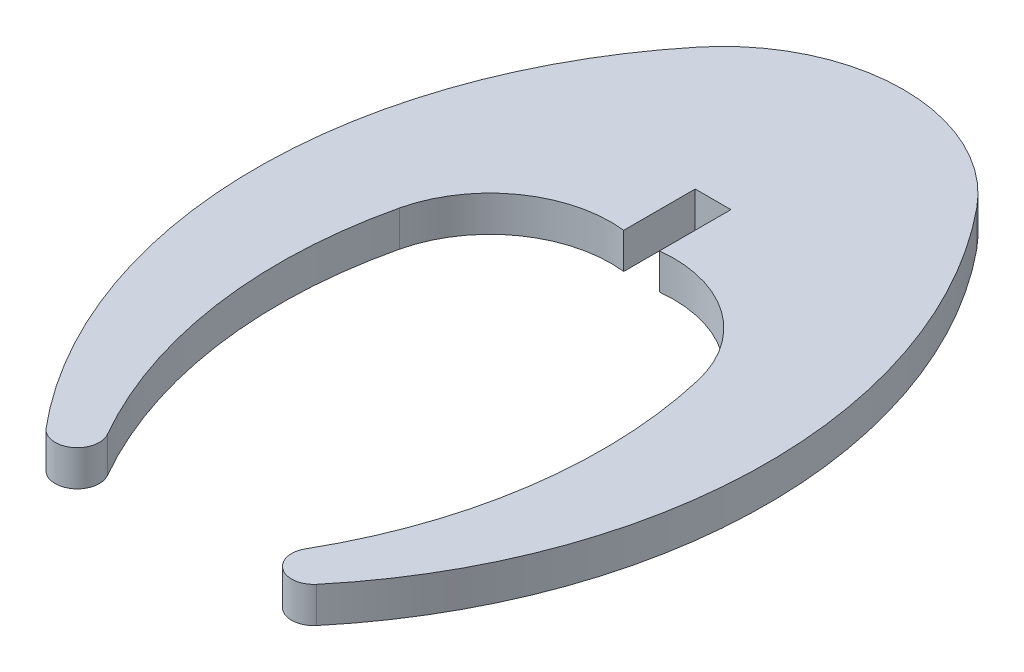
ISO-10303-21;
HEADER;
FILE_DESCRIPTION(('STEP AP214'),'2;1');
FILE_NAME('part.step','',(''),(''),'','','');
FILE_SCHEMA(('AUTOMOTIVE_DESIGN { 1 0 10303 214 1 1 1 1 }'));
ENDSEC;
DATA;
#1=APPLICATION_CONTEXT('core data for automotive mechanical design processes');
#2=APPLICATION_PROTOCOL_DEFINITION('international standard','automotive_design',2000,#1);
#3=PRODUCT_CONTEXT('',#1,'mechanical');
#4=PRODUCT('Part','Part','',(#3));
#5=PRODUCT_RELATED_PRODUCT_CATEGORY('part','',(#4));
#6=PRODUCT_DEFINITION_FORMATION('','',#4);
#7=PRODUCT_DEFINITION_CONTEXT('part definition',#1,'design');
#8=PRODUCT_DEFINITION('design','',#6,#7);
#9=PRODUCT_DEFINITION_SHAPE('','',#8);
#10=(LENGTH_UNIT() NAMED_UNIT(*) SI_UNIT(.MILLI.,.METRE.));
#11=(NAMED_UNIT(*) PLANE_ANGLE_UNIT() SI_UNIT($,.RADIAN.));
#12=(NAMED_UNIT(*) SI_UNIT($,.STERADIAN.) SOLID_ANGLE_UNIT());
#13=UNCERTAINTY_MEASURE_WITH_UNIT(LENGTH_MEASURE(1.E-05),#10,'distance_accuracy_value','');
#14=(GEOMETRIC_REPRESENTATION_CONTEXT(3) GLOBAL_UNCERTAINTY_ASSIGNED_CONTEXT((#13)) GLOBAL_UNIT_ASSIGNED_CONTEXT((#10,
#11,#12)) REPRESENTATION_CONTEXT('',''));
#15=CARTESIAN_POINT('',(0.,0.,0.));
#16=DIRECTION('',(0.,0.,1.));
#17=DIRECTION('',(1.,0.,0.));
#18=AXIS2_PLACEMENT_3D('',#15,#16,#17);
#19=CARTESIAN_POINT('',(-42090.820528,3.,-18279.410788));
#20=DIRECTION('',(-0.999999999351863,0.,-3.60037906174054E-05));
#21=DIRECTION('',(-3.60037906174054E-05,0.,0.999999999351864));
#22=AXIS2_PLACEMENT_3D('',#19,#20,#21);
#23=PLANE('',#22);
#24=DIRECTION('',(3.60037906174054E-05,0.,-0.999999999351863));
#25=VECTOR('',#24,1.);
#26=CARTESIAN_POINT('',(-42090.820528,0.,-18279.410788));
#27=LINE('',#26,#25);
#28=CARTESIAN_POINT('',(-42090.820528,0.,-18279.410788));
#29=VERTEX_POINT('',#28);
#30=CARTESIAN_POINT('',(-42090.820312,0.,-18285.410156));
#31=VERTEX_POINT('',#30);
#32=EDGE_CURVE('E156',#29,#31,#27,.T.);
#33=ORIENTED_EDGE('',*,*,#32,.T.);
#34=DIRECTION('',(0.,-1.,0.));
#35=VECTOR('',#34,1.);
#36=CARTESIAN_POINT('',(-42090.820312,3.,-18285.410156));
#37=LINE('',#36,#35);
#38=CARTESIAN_POINT('',(-42090.820312,3.,-18285.410156));
#39=VERTEX_POINT('',#38);
#40=EDGE_CURVE('E11',#39,#31,#37,.T.);
#41=ORIENTED_EDGE('',*,*,#40,.F.);
#42=DIRECTION('',(3.60037906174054E-05,0.,-0.999999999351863));
#43=VECTOR('',#42,1.);
#44=CARTESIAN_POINT('',(-42090.820528,3.,-18279.410788));
#45=LINE('',#44,#43);
#46=CARTESIAN_POINT('',(-42090.820528,3.,-18279.410788));
#47=VERTEX_POINT('',#46);
#48=EDGE_CURVE('E178',#47,#39,#45,.T.);
#49=ORIENTED_EDGE('',*,*,#48,.F.);
#50=DIRECTION('',(0.,-1.,0.));
#51=VECTOR('',#50,1.);
#52=CARTESIAN_POINT('',(-42090.820528,3.,-18279.410788));
#53=LINE('',#52,#51);
#54=EDGE_CURVE('E152',#47,#29,#53,.T.);
#55=ORIENTED_EDGE('',*,*,#54,.T.);
#56=EDGE_LOOP('',(#33,#41,#49,#55));
#57=FACE_BOUND('',#56,.T.);
#58=ADVANCED_FACE('F36',(#57),#23,.F.);
#59=CARTESIAN_POINT('',(-42090.820312,3.,-18285.410156));
#60=DIRECTION('',(-0.00065099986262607,0.,-0.999999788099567));
#61=DIRECTION('',(-0.999999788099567,0.,0.00065099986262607));
#62=AXIS2_PLACEMENT_3D('',#59,#60,#61);
#63=PLANE('',#62);
#64=DIRECTION('',(0.999999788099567,0.,-0.00065099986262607));
#65=VECTOR('',#64,1.);
#66=CARTESIAN_POINT('',(-42090.820312,0.,-18285.410156));
#67=LINE('',#66,#65);
#68=CARTESIAN_POINT('',(-42087.820312,0.,-18285.412109));
#69=VERTEX_POINT('',#68);
#70=EDGE_CURVE('E159',#31,#69,#67,.T.);
#71=ORIENTED_EDGE('',*,*,#70,.T.);
#72=DIRECTION('',(0.,-1.,0.));
#73=VECTOR('',#72,1.);
#74=CARTESIAN_POINT('',(-42087.820312,3.,-18285.412109));
#75=LINE('',#74,#73);
#76=CARTESIAN_POINT('',(-42087.820312,3.,-18285.412109));
#77=VERTEX_POINT('',#76);
#78=EDGE_CURVE('E44',#77,#69,#75,.T.);
#79=ORIENTED_EDGE('',*,*,#78,.F.);
#80=DIRECTION('',(0.999999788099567,0.,-0.00065099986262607));
#81=VECTOR('',#80,1.);
#82=CARTESIAN_POINT('',(-42090.820312,3.,-18285.410156));
#83=LINE('',#82,#81);
#84=EDGE_CURVE('E107',#39,#77,#83,.T.);
#85=ORIENTED_EDGE('',*,*,#84,.F.);
#86=ORIENTED_EDGE('',*,*,#40,.T.);
#87=EDGE_LOOP('',(#71,#79,#85,#86));
#88=FACE_BOUND('',#87,.T.);
#89=ADVANCED_FACE('F256',(#88),#63,.F.);
#90=CARTESIAN_POINT('',(-42087.820312,3.,-18285.412109));
#91=DIRECTION('',(1.,0.,3.55387046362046E-12));
#92=DIRECTION('',(3.55387046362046E-12,0.,-1.));
#93=AXIS2_PLACEMENT_3D('',#90,#91,#92);
#94=PLANE('',#93);
#95=DIRECTION('',(-3.55387046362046E-12,0.,1.));
#96=VECTOR('',#95,1.);
#97=CARTESIAN_POINT('',(-42087.820312,0.,-18285.412109));
#98=LINE('',#97,#96);
#99=CARTESIAN_POINT('',(-42087.820312,0.,-18279.414062));
#100=VERTEX_POINT('',#99);
#101=EDGE_CURVE('E161',#69,#100,#98,.T.);
#102=ORIENTED_EDGE('',*,*,#101,.T.);
#103=DIRECTION('',(0.,-1.,0.));
#104=VECTOR('',#103,1.);
#105=CARTESIAN_POINT('',(-42087.820312,3.,-18279.414062));
#106=LINE('',#105,#104);
#107=CARTESIAN_POINT('',(-42087.820312,3.,-18279.414062));
#108=VERTEX_POINT('',#107);
#109=EDGE_CURVE('E197',#108,#100,#106,.T.);
#110=ORIENTED_EDGE('',*,*,#109,.F.);
#111=DIRECTION('',(-3.55387046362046E-12,0.,1.));
#112=VECTOR('',#111,1.);
#113=CARTESIAN_POINT('',(-42087.820312,3.,-18285.412109));
#114=LINE('',#113,#112);
#115=EDGE_CURVE('E205',#77,#108,#114,.T.);
#116=ORIENTED_EDGE('',*,*,#115,.F.);
#117=ORIENTED_EDGE('',*,*,#78,.T.);
#118=EDGE_LOOP('',(#102,#110,#116,#117));
#119=FACE_BOUND('',#118,.T.);
#120=ADVANCED_FACE('F203',(#119),#94,.F.);
#121=CARTESIAN_POINT('',(-42086.6928866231,3.,-18269.3115927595));
#122=DIRECTION('',(0.,-1.,0.));
#123=DIRECTION('',(0.,0.,-1.));
#124=AXIS2_PLACEMENT_3D('',#121,#122,#123);
#125=CYLINDRICAL_SURFACE('',#124,10.1651843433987);
#126=CARTESIAN_POINT('',(-42086.6928866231,0.,-18269.3115927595));
#127=DIRECTION('',(0.,-1.,0.));
#128=DIRECTION('',(0.,0.,1.));
#129=AXIS2_PLACEMENT_3D('',#126,#127,#128);
#130=CIRCLE('',#129,10.1651843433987);
#131=CARTESIAN_POINT('',(-42076.7948740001,0.,-18271.626829));
#132=VERTEX_POINT('',#131);
#133=EDGE_CURVE('E163',#100,#132,#130,.T.);
#134=ORIENTED_EDGE('',*,*,#133,.T.);
#135=DIRECTION('',(0.,-1.,0.));
#136=VECTOR('',#135,1.);
#137=CARTESIAN_POINT('',(-42076.7948740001,3.,-18271.626829));
#138=LINE('',#137,#136);
#139=CARTESIAN_POINT('',(-42076.7948740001,3.,-18271.626829));
#140=VERTEX_POINT('',#139);
#141=EDGE_CURVE('E194',#140,#132,#138,.T.);
#142=ORIENTED_EDGE('',*,*,#141,.F.);
#143=CARTESIAN_POINT('',(-42086.6928866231,3.,-18269.3115927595));
#144=DIRECTION('',(0.,-1.,0.));
#145=DIRECTION('',(0.,0.,1.));
#146=AXIS2_PLACEMENT_3D('',#143,#144,#145);
#147=CIRCLE('',#146,10.1651843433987);
#148=EDGE_CURVE('E223',#108,#140,#147,.T.);
#149=ORIENTED_EDGE('',*,*,#148,.F.);
#150=ORIENTED_EDGE('',*,*,#109,.T.);
#151=EDGE_LOOP('',(#134,#142,#149,#150));
#152=FACE_BOUND('',#151,.T.);
#153=ADVANCED_FACE('F214',(#152),#125,.F.);
#154=CARTESIAN_POINT('',(-42115.347379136,3.,-18262.6034486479));
#155=DIRECTION('',(0.,-1.,0.));
#156=DIRECTION('',(0.,0.,-1.));
#157=AXIS2_PLACEMENT_3D('',#154,#155,#156);
#158=CYLINDRICAL_SURFACE('',#157,39.5944067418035);
#159=CARTESIAN_POINT('',(-42115.347379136,0.,-18262.6034486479));
#160=DIRECTION('',(0.,-1.,0.));
#161=DIRECTION('',(0.,0.,1.));
#162=AXIS2_PLACEMENT_3D('',#159,#160,#161);
#163=CIRCLE('',#162,39.5944067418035);
#164=CARTESIAN_POINT('',(-42081.0128680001,0.,-18242.883956));
#165=VERTEX_POINT('',#164);
#166=EDGE_CURVE('E165',#132,#165,#163,.T.);
#167=ORIENTED_EDGE('',*,*,#166,.T.);
#168=DIRECTION('',(0.,-1.,0.));
#169=VECTOR('',#168,1.);
#170=CARTESIAN_POINT('',(-42081.0128680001,3.,-18242.883956));
#171=LINE('',#170,#169);
#172=CARTESIAN_POINT('',(-42081.0128680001,3.,-18242.883956));
#173=VERTEX_POINT('',#172);
#174=EDGE_CURVE('E191',#173,#165,#171,.T.);
#175=ORIENTED_EDGE('',*,*,#174,.F.);
#176=CARTESIAN_POINT('',(-42115.347379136,3.,-18262.6034486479));
#177=DIRECTION('',(0.,-1.,0.));
#178=DIRECTION('',(0.,0.,1.));
#179=AXIS2_PLACEMENT_3D('',#176,#177,#178);
#180=CIRCLE('',#179,39.5944067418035);
#181=EDGE_CURVE('E220',#140,#173,#180,.T.);
#182=ORIENTED_EDGE('',*,*,#181,.F.);
#183=ORIENTED_EDGE('',*,*,#141,.T.);
#184=EDGE_LOOP('',(#167,#175,#182,#183));
#185=FACE_BOUND('',#184,.T.);
#186=ADVANCED_FACE('F218',(#185),#158,.F.);
#187=CARTESIAN_POINT('',(-42079.3989444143,3.,-18241.9593376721));
#188=DIRECTION('',(0.,-1.,0.));
#189=DIRECTION('',(0.,0.,-1.));
#190=AXIS2_PLACEMENT_3D('',#187,#188,#189);
#191=CYLINDRICAL_SURFACE('',#190,1.86001838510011);
#192=CARTESIAN_POINT('',(-42079.3989444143,0.,-18241.9593376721));
#193=DIRECTION('',(0.,1.,0.));
#194=DIRECTION('',(0.,0.,1.));
#195=AXIS2_PLACEMENT_3D('',#192,#193,#194);
#196=CIRCLE('',#195,1.86001838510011);
#197=CARTESIAN_POINT('',(-42077.9729450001,0.,-18240.765104));
#198=VERTEX_POINT('',#197);
#199=EDGE_CURVE('E167',#165,#198,#196,.T.);
#200=ORIENTED_EDGE('',*,*,#199,.T.);
#201=DIRECTION('',(0.,-1.,0.));
#202=VECTOR('',#201,1.);
#203=CARTESIAN_POINT('',(-42077.9729450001,3.,-18240.765104));
#204=LINE('',#203,#202);
#205=CARTESIAN_POINT('',(-42077.9729450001,3.,-18240.765104));
#206=VERTEX_POINT('',#205);
#207=EDGE_CURVE('E188',#206,#198,#204,.T.);
#208=ORIENTED_EDGE('',*,*,#207,.F.);
#209=CARTESIAN_POINT('',(-42079.3989444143,3.,-18241.9593376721));
#210=DIRECTION('',(0.,1.,0.));
#211=DIRECTION('',(0.,0.,1.));
#212=AXIS2_PLACEMENT_3D('',#209,#210,#211);
#213=CIRCLE('',#212,1.86001838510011);
#214=EDGE_CURVE('E222',#173,#206,#213,.T.);
#215=ORIENTED_EDGE('',*,*,#214,.F.);
#216=ORIENTED_EDGE('',*,*,#174,.T.);
#217=EDGE_LOOP('',(#200,#208,#215,#216));
#218=FACE_BOUND('',#217,.T.);
#219=ADVANCED_FACE('F269',(#218),#191,.T.);
#220=CARTESIAN_POINT('',(-42111.0898426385,3.,-18268.5236321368));
#221=DIRECTION('',(0.,-1.,0.));
#222=DIRECTION('',(0.,0.,-1.));
#223=AXIS2_PLACEMENT_3D('',#220,#221,#222);
#224=CYLINDRICAL_SURFACE('',#223,43.2118594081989);
#225=CARTESIAN_POINT('',(-42111.0898426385,0.,-18268.5236321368));
#226=DIRECTION('',(0.,1.,0.));
#227=DIRECTION('',(0.,0.,1.));
#228=AXIS2_PLACEMENT_3D('',#225,#226,#227);
#229=CIRCLE('',#228,43.2118594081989);
#230=CARTESIAN_POINT('',(-42077.5888019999,0.,-18295.817314));
#231=VERTEX_POINT('',#230);
#232=EDGE_CURVE('E169',#198,#231,#229,.T.);
#233=ORIENTED_EDGE('',*,*,#232,.T.);
#234=DIRECTION('',(0.,-1.,0.));
#235=VECTOR('',#234,1.);
#236=CARTESIAN_POINT('',(-42077.5888019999,3.,-18295.817314));
#237=LINE('',#236,#235);
#238=CARTESIAN_POINT('',(-42077.5888019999,3.,-18295.817314));
#239=VERTEX_POINT('',#238);
#240=EDGE_CURVE('E185',#239,#231,#237,.T.);
#241=ORIENTED_EDGE('',*,*,#240,.F.);
#242=CARTESIAN_POINT('',(-42111.0898426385,3.,-18268.5236321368));
#243=DIRECTION('',(0.,1.,0.));
#244=DIRECTION('',(0.,0.,1.));
#245=AXIS2_PLACEMENT_3D('',#242,#243,#244);
#246=CIRCLE('',#245,43.2118594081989);
#247=EDGE_CURVE('E225',#206,#239,#246,.T.);
#248=ORIENTED_EDGE('',*,*,#247,.F.);
#249=ORIENTED_EDGE('',*,*,#207,.T.);
#250=EDGE_LOOP('',(#233,#241,#248,#249));
#251=FACE_BOUND('',#250,.T.);
#252=ADVANCED_FACE('F272',(#251),#224,.T.);
#253=CARTESIAN_POINT('',(-42089.3182387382,3.,-18286.2597653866));
#254=DIRECTION('',(0.,-1.,0.));
#255=DIRECTION('',(0.,0.,-1.));
#256=AXIS2_PLACEMENT_3D('',#253,#254,#255);
#257=CYLINDRICAL_SURFACE('',#256,15.1303146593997);
#258=CARTESIAN_POINT('',(-42089.3182387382,0.,-18286.2597653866));
#259=DIRECTION('',(0.,1.,0.));
#260=DIRECTION('',(0.,0.,1.));
#261=AXIS2_PLACEMENT_3D('',#258,#259,#260);
#262=CIRCLE('',#261,15.1303146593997);
#263=CARTESIAN_POINT('',(-42101.04196,0.,-18295.824324));
#264=VERTEX_POINT('',#263);
#265=EDGE_CURVE('E171',#231,#264,#262,.T.);
#266=ORIENTED_EDGE('',*,*,#265,.T.);
#267=DIRECTION('',(0.,-1.,0.));
#268=VECTOR('',#267,1.);
#269=CARTESIAN_POINT('',(-42101.04196,3.,-18295.824324));
#270=LINE('',#269,#268);
#271=CARTESIAN_POINT('',(-42101.04196,3.,-18295.824324));
#272=VERTEX_POINT('',#271);
#273=EDGE_CURVE('E182',#272,#264,#270,.T.);
#274=ORIENTED_EDGE('',*,*,#273,.F.);
#275=CARTESIAN_POINT('',(-42089.3182387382,3.,-18286.2597653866));
#276=DIRECTION('',(0.,1.,0.));
#277=DIRECTION('',(0.,0.,1.));
#278=AXIS2_PLACEMENT_3D('',#275,#276,#277);
#279=CIRCLE('',#278,15.1303146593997);
#280=EDGE_CURVE('E231',#239,#272,#279,.T.);
#281=ORIENTED_EDGE('',*,*,#280,.F.);
#282=ORIENTED_EDGE('',*,*,#240,.T.);
#283=EDGE_LOOP('',(#266,#274,#281,#282));
#284=FACE_BOUND('',#283,.T.);
#285=ADVANCED_FACE('F237',(#284),#257,.T.);
#286=CARTESIAN_POINT('',(-42067.55469282,3.,-18268.512630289));
#287=DIRECTION('',(0.,-1.,0.));
#288=DIRECTION('',(0.,0.,-1.));
#289=AXIS2_PLACEMENT_3D('',#286,#287,#288);
#290=CYLINDRICAL_SURFACE('',#289,43.212563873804);
#291=CARTESIAN_POINT('',(-42067.55469282,0.,-18268.512630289));
#292=DIRECTION('',(0.,1.,0.));
#293=DIRECTION('',(0.,0.,1.));
#294=AXIS2_PLACEMENT_3D('',#291,#292,#293);
#295=CIRCLE('',#294,43.212563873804);
#296=CARTESIAN_POINT('',(-42100.690387,0.,-18240.775445));
#297=VERTEX_POINT('',#296);
#298=EDGE_CURVE('E173',#264,#297,#295,.T.);
#299=ORIENTED_EDGE('',*,*,#298,.T.);
#300=DIRECTION('',(0.,-1.,0.));
#301=VECTOR('',#300,1.);
#302=CARTESIAN_POINT('',(-42100.690387,3.,-18240.775445));
#303=LINE('',#302,#301);
#304=CARTESIAN_POINT('',(-42100.690387,3.,-18240.775445));
#305=VERTEX_POINT('',#304);
#306=EDGE_CURVE('E147',#305,#297,#303,.T.);
#307=ORIENTED_EDGE('',*,*,#306,.F.);
#308=CARTESIAN_POINT('',(-42067.55469282,3.,-18268.512630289));
#309=DIRECTION('',(0.,1.,0.));
#310=DIRECTION('',(0.,0.,1.));
#311=AXIS2_PLACEMENT_3D('',#308,#309,#310);
#312=CIRCLE('',#311,43.212563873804);
#313=EDGE_CURVE('E138',#272,#305,#312,.T.);
#314=ORIENTED_EDGE('',*,*,#313,.F.);
#315=ORIENTED_EDGE('',*,*,#273,.T.);
#316=EDGE_LOOP('',(#299,#307,#314,#315));
#317=FACE_BOUND('',#316,.T.);
#318=ADVANCED_FACE('F241',(#317),#290,.T.);
#319=CARTESIAN_POINT('',(-42099.2668809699,3.,-18241.9666884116));
#320=DIRECTION('',(0.,-1.,0.));
#321=DIRECTION('',(0.,0.,-1.));
#322=AXIS2_PLACEMENT_3D('',#319,#320,#321);
#323=CYLINDRICAL_SURFACE('',#322,1.85618702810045);
#324=CARTESIAN_POINT('',(-42099.2668809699,0.,-18241.9666884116));
#325=DIRECTION('',(0.,1.,0.));
#326=DIRECTION('',(0.,0.,1.));
#327=AXIS2_PLACEMENT_3D('',#324,#325,#326);
#328=CIRCLE('',#327,1.85618702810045);
#329=CARTESIAN_POINT('',(-42097.655369,0.,-18242.887807));
#330=VERTEX_POINT('',#329);
#331=EDGE_CURVE('E146',#297,#330,#328,.T.);
#332=ORIENTED_EDGE('',*,*,#331,.T.);
#333=DIRECTION('',(0.,-1.,0.));
#334=VECTOR('',#333,1.);
#335=CARTESIAN_POINT('',(-42097.655369,3.,-18242.887807));
#336=LINE('',#335,#334);
#337=CARTESIAN_POINT('',(-42097.655369,3.,-18242.887807));
#338=VERTEX_POINT('',#337);
#339=EDGE_CURVE('E143',#338,#330,#336,.T.);
#340=ORIENTED_EDGE('',*,*,#339,.F.);
#341=CARTESIAN_POINT('',(-42099.2668809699,3.,-18241.9666884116));
#342=DIRECTION('',(0.,1.,0.));
#343=DIRECTION('',(0.,0.,1.));
#344=AXIS2_PLACEMENT_3D('',#341,#342,#343);
#345=CIRCLE('',#344,1.85618702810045);
#346=EDGE_CURVE('E132',#305,#338,#345,.T.);
#347=ORIENTED_EDGE('',*,*,#346,.F.);
#348=ORIENTED_EDGE('',*,*,#306,.T.);
#349=EDGE_LOOP('',(#332,#340,#347,#348));
#350=FACE_BOUND('',#349,.T.);
#351=ADVANCED_FACE('F144',(#350),#323,.T.);
#352=CARTESIAN_POINT('',(-42063.3086471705,3.,-18262.5843479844));
#353=DIRECTION('',(0.,-1.,0.));
#354=DIRECTION('',(0.,0.,-1.));
#355=AXIS2_PLACEMENT_3D('',#352,#353,#354);
#356=CYLINDRICAL_SURFACE('',#355,39.5935730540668);
#357=CARTESIAN_POINT('',(-42063.3086471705,0.,-18262.5843479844));
#358=DIRECTION('',(0.,-1.,0.));
#359=DIRECTION('',(0.,0.,1.));
#360=AXIS2_PLACEMENT_3D('',#357,#358,#359);
#361=CIRCLE('',#360,39.5935730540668);
#362=CARTESIAN_POINT('',(-42101.854415,0.,-18271.632818));
#363=VERTEX_POINT('',#362);
#364=EDGE_CURVE('E93',#330,#363,#361,.T.);
#365=ORIENTED_EDGE('',*,*,#364,.T.);
#366=DIRECTION('',(0.,-1.,0.));
#367=VECTOR('',#366,1.);
#368=CARTESIAN_POINT('',(-42101.854415,3.,-18271.632818));
#369=LINE('',#368,#367);
#370=CARTESIAN_POINT('',(-42101.854415,3.,-18271.632818));
#371=VERTEX_POINT('',#370);
#372=EDGE_CURVE('E148',#371,#363,#369,.T.);
#373=ORIENTED_EDGE('',*,*,#372,.F.);
#374=CARTESIAN_POINT('',(-42063.3086471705,3.,-18262.5843479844));
#375=DIRECTION('',(0.,-1.,0.));
#376=DIRECTION('',(0.,0.,1.));
#377=AXIS2_PLACEMENT_3D('',#374,#375,#376);
#378=CIRCLE('',#377,39.5935730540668);
#379=EDGE_CURVE('E136',#338,#371,#378,.T.);
#380=ORIENTED_EDGE('',*,*,#379,.F.);
#381=ORIENTED_EDGE('',*,*,#339,.T.);
#382=EDGE_LOOP('',(#365,#373,#380,#381));
#383=FACE_BOUND('',#382,.T.);
#384=ADVANCED_FACE('F150',(#383),#356,.F.);
#385=CARTESIAN_POINT('',(-42091.9583825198,3.,-18269.3095942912));
#386=DIRECTION('',(0.,-1.,0.));
#387=DIRECTION('',(0.,0.,-1.));
#388=AXIS2_PLACEMENT_3D('',#385,#386,#387);
#389=CYLINDRICAL_SURFACE('',#388,10.1650788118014);
#390=CARTESIAN_POINT('',(-42091.9583825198,0.,-18269.3095942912));
#391=DIRECTION('',(0.,-1.,0.));
#392=DIRECTION('',(0.,0.,1.));
#393=AXIS2_PLACEMENT_3D('',#390,#391,#392);
#394=CIRCLE('',#393,10.1650788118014);
#395=EDGE_CURVE('E99',#363,#29,#394,.T.);
#396=ORIENTED_EDGE('',*,*,#395,.T.);
#397=ORIENTED_EDGE('',*,*,#54,.F.);
#398=CARTESIAN_POINT('',(-42091.9583825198,3.,-18269.3095942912));
#399=DIRECTION('',(0.,-1.,0.));
#400=DIRECTION('',(0.,0.,1.));
#401=AXIS2_PLACEMENT_3D('',#398,#399,#400);
#402=CIRCLE('',#401,10.1650788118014);
#403=EDGE_CURVE('E52',#371,#47,#402,.T.);
#404=ORIENTED_EDGE('',*,*,#403,.F.);
#405=ORIENTED_EDGE('',*,*,#372,.T.);
#406=EDGE_LOOP('',(#396,#397,#404,#405));
#407=FACE_BOUND('',#406,.T.);
#408=ADVANCED_FACE('F245',(#407),#389,.F.);
#409=CARTESIAN_POINT('',(-42086.6928866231,3.,-18269.3115927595));
#410=DIRECTION('',(0.,1.,0.));
#411=DIRECTION('',(0.,0.,1.));
#412=AXIS2_PLACEMENT_3D('',#409,#410,#411);
#413=PLANE('',#412);
#414=ORIENTED_EDGE('',*,*,#48,.T.);
#415=ORIENTED_EDGE('',*,*,#84,.T.);
#416=ORIENTED_EDGE('',*,*,#115,.T.);
#417=ORIENTED_EDGE('',*,*,#148,.T.);
#418=ORIENTED_EDGE('',*,*,#181,.T.);
#419=ORIENTED_EDGE('',*,*,#214,.T.);
#420=ORIENTED_EDGE('',*,*,#247,.T.);
#421=ORIENTED_EDGE('',*,*,#280,.T.);
#422=ORIENTED_EDGE('',*,*,#313,.T.);
#423=ORIENTED_EDGE('',*,*,#346,.T.);
#424=ORIENTED_EDGE('',*,*,#379,.T.);
#425=ORIENTED_EDGE('',*,*,#403,.T.);
#426=EDGE_LOOP('',(#414,#415,#416,#417,#418,#419,#420,#421,#422,#423,#424,#425));
#427=FACE_BOUND('',#426,.T.);
#428=ADVANCED_FACE('F134',(#427),#413,.T.);
#429=CARTESIAN_POINT('',(-42086.6928866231,0.,-18269.3115927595));
#430=DIRECTION('',(0.,1.,0.));
#431=DIRECTION('',(0.,0.,1.));
#432=AXIS2_PLACEMENT_3D('',#429,#430,#431);
#433=PLANE('',#432);
#434=ORIENTED_EDGE('',*,*,#32,.F.);
#435=ORIENTED_EDGE('',*,*,#395,.F.);
#436=ORIENTED_EDGE('',*,*,#364,.F.);
#437=ORIENTED_EDGE('',*,*,#331,.F.);
#438=ORIENTED_EDGE('',*,*,#298,.F.);
#439=ORIENTED_EDGE('',*,*,#265,.F.);
#440=ORIENTED_EDGE('',*,*,#232,.F.);
#441=ORIENTED_EDGE('',*,*,#199,.F.);
#442=ORIENTED_EDGE('',*,*,#166,.F.);
#443=ORIENTED_EDGE('',*,*,#133,.F.);
#444=ORIENTED_EDGE('',*,*,#101,.F.);
#445=ORIENTED_EDGE('',*,*,#70,.F.);
#446=EDGE_LOOP('',(#434,#435,#436,#437,#438,#439,#440,#441,#442,#443,#444,#445));
#447=FACE_BOUND('',#446,.T.);
#448=ADVANCED_FACE('F209',(#447),#433,.F.);
#449=CLOSED_SHELL('',(#58,#89,#120,#153,#186,#219,#252,#285,#318,#351,#384,#408,#428,#448));
#450=MANIFOLD_SOLID_BREP('B2',#449);
#451=ADVANCED_BREP_SHAPE_REPRESENTATION('',(#18,#450),#14);
#452=SHAPE_DEFINITION_REPRESENTATION(#9,#451);
ENDSEC;
END-ISO-10303-21;
